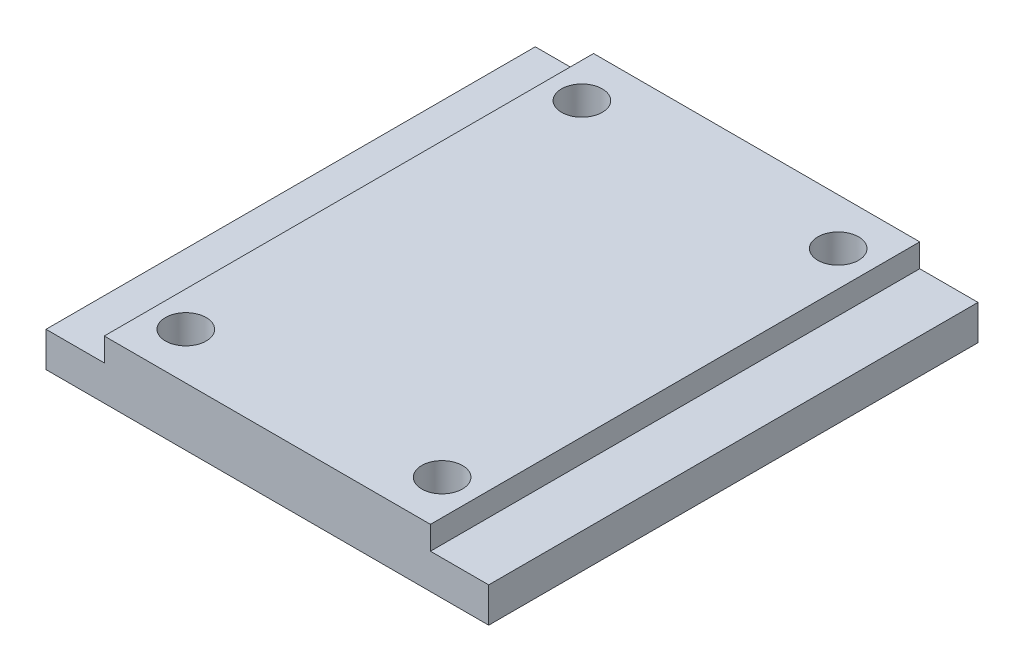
ISO-10303-21;
HEADER;
FILE_DESCRIPTION(('STEP AP214'),'2;1');
FILE_NAME('part.step','',(''),(''),'','','');
FILE_SCHEMA(('AUTOMOTIVE_DESIGN { 1 0 10303 214 1 1 1 1 }'));
ENDSEC;
DATA;
#1=APPLICATION_CONTEXT('core data for automotive mechanical design processes');
#2=APPLICATION_PROTOCOL_DEFINITION('international standard','automotive_design',2000,#1);
#3=PRODUCT_CONTEXT('',#1,'mechanical');
#4=PRODUCT('Part','Part','',(#3));
#5=PRODUCT_RELATED_PRODUCT_CATEGORY('part','',(#4));
#6=PRODUCT_DEFINITION_FORMATION('','',#4);
#7=PRODUCT_DEFINITION_CONTEXT('part definition',#1,'design');
#8=PRODUCT_DEFINITION('design','',#6,#7);
#9=PRODUCT_DEFINITION_SHAPE('','',#8);
#10=(LENGTH_UNIT() NAMED_UNIT(*) SI_UNIT(.MILLI.,.METRE.));
#11=(NAMED_UNIT(*) PLANE_ANGLE_UNIT() SI_UNIT($,.RADIAN.));
#12=(NAMED_UNIT(*) SI_UNIT($,.STERADIAN.) SOLID_ANGLE_UNIT());
#13=UNCERTAINTY_MEASURE_WITH_UNIT(LENGTH_MEASURE(1.E-05),#10,'distance_accuracy_value','');
#14=(GEOMETRIC_REPRESENTATION_CONTEXT(3) GLOBAL_UNCERTAINTY_ASSIGNED_CONTEXT((#13)) GLOBAL_UNIT_ASSIGNED_CONTEXT((#10,
#11,#12)) REPRESENTATION_CONTEXT('',''));
#15=CARTESIAN_POINT('',(0.,0.,0.));
#16=DIRECTION('',(0.,0.,1.));
#17=DIRECTION('',(1.,0.,0.));
#18=AXIS2_PLACEMENT_3D('',#15,#16,#17);
#19=CARTESIAN_POINT('',(0.,0.,21.));
#20=DIRECTION('',(0.,1.,0.));
#21=DIRECTION('',(-1.,0.,0.));
#22=AXIS2_PLACEMENT_3D('',#19,#20,#21);
#23=PLANE('',#22);
#24=DIRECTION('',(0.866025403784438,0.,-0.5));
#25=VECTOR('',#24,1.);
#26=CARTESIAN_POINT('',(-11.,0.,-13.5358983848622));
#27=LINE('',#26,#25);
#28=CARTESIAN_POINT('',(-11.,0.,-13.5358983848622));
#29=VERTEX_POINT('',#28);
#30=CARTESIAN_POINT('',(-8.,0.,-15.2679491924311));
#31=VERTEX_POINT('',#30);
#32=EDGE_CURVE('E433',#29,#31,#27,.T.);
#33=ORIENTED_EDGE('',*,*,#32,.T.);
#34=DIRECTION('',(0.,0.,-1.));
#35=VECTOR('',#34,1.);
#36=CARTESIAN_POINT('',(-8.,0.,-15.2679491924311));
#37=LINE('',#36,#35);
#38=CARTESIAN_POINT('',(-8.,0.,-18.7320508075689));
#39=VERTEX_POINT('',#38);
#40=EDGE_CURVE('E439',#31,#39,#37,.T.);
#41=ORIENTED_EDGE('',*,*,#40,.T.);
#42=DIRECTION('',(-0.866025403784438,0.,-0.500000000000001));
#43=VECTOR('',#42,1.);
#44=CARTESIAN_POINT('',(-8.,0.,-18.7320508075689));
#45=LINE('',#44,#43);
#46=CARTESIAN_POINT('',(-11.,0.,-20.4641016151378));
#47=VERTEX_POINT('',#46);
#48=EDGE_CURVE('E470',#39,#47,#45,.T.);
#49=ORIENTED_EDGE('',*,*,#48,.T.);
#50=DIRECTION('',(-0.866025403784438,0.,0.500000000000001));
#51=VECTOR('',#50,1.);
#52=CARTESIAN_POINT('',(-11.,0.,-20.4641016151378));
#53=LINE('',#52,#51);
#54=CARTESIAN_POINT('',(-14.,0.,-18.7320508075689));
#55=VERTEX_POINT('',#54);
#56=EDGE_CURVE('E466',#47,#55,#53,.T.);
#57=ORIENTED_EDGE('',*,*,#56,.T.);
#58=DIRECTION('',(0.,0.,1.));
#59=VECTOR('',#58,1.);
#60=CARTESIAN_POINT('',(-14.,0.,-18.7320508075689));
#61=LINE('',#60,#59);
#62=CARTESIAN_POINT('',(-14.,0.,-15.2679491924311));
#63=VERTEX_POINT('',#62);
#64=EDGE_CURVE('E462',#55,#63,#61,.T.);
#65=ORIENTED_EDGE('',*,*,#64,.T.);
#66=DIRECTION('',(0.866025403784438,0.,0.5));
#67=VECTOR('',#66,1.);
#68=CARTESIAN_POINT('',(-14.,0.,-15.2679491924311));
#69=LINE('',#68,#67);
#70=EDGE_CURVE('E458',#63,#29,#69,.T.);
#71=ORIENTED_EDGE('',*,*,#70,.T.);
#72=EDGE_LOOP('',(#33,#41,#49,#57,#65,#71));
#73=FACE_BOUND('',#72,.T.);
#74=DIRECTION('',(0.,0.,1.));
#75=VECTOR('',#74,1.);
#76=CARTESIAN_POINT('',(-8.,0.,15.2679491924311));
#77=LINE('',#76,#75);
#78=CARTESIAN_POINT('',(-8.,0.,15.2679491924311));
#79=VERTEX_POINT('',#78);
#80=CARTESIAN_POINT('',(-8.,0.,18.7320508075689));
#81=VERTEX_POINT('',#80);
#82=EDGE_CURVE('E530',#79,#81,#77,.T.);
#83=ORIENTED_EDGE('',*,*,#82,.F.);
#84=DIRECTION('',(0.866025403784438,0.,0.5));
#85=VECTOR('',#84,1.);
#86=CARTESIAN_POINT('',(-11.,0.,13.5358983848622));
#87=LINE('',#86,#85);
#88=CARTESIAN_POINT('',(-11.,0.,13.5358983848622));
#89=VERTEX_POINT('',#88);
#90=EDGE_CURVE('E501',#89,#79,#87,.T.);
#91=ORIENTED_EDGE('',*,*,#90,.F.);
#92=DIRECTION('',(0.866025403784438,0.,-0.5));
#93=VECTOR('',#92,1.);
#94=CARTESIAN_POINT('',(-14.,0.,15.2679491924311));
#95=LINE('',#94,#93);
#96=CARTESIAN_POINT('',(-14.,0.,15.2679491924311));
#97=VERTEX_POINT('',#96);
#98=EDGE_CURVE('E507',#97,#89,#95,.T.);
#99=ORIENTED_EDGE('',*,*,#98,.F.);
#100=DIRECTION('',(0.,0.,-1.));
#101=VECTOR('',#100,1.);
#102=CARTESIAN_POINT('',(-14.,0.,18.7320508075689));
#103=LINE('',#102,#101);
#104=CARTESIAN_POINT('',(-14.,0.,18.7320508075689));
#105=VERTEX_POINT('',#104);
#106=EDGE_CURVE('E542',#105,#97,#103,.T.);
#107=ORIENTED_EDGE('',*,*,#106,.F.);
#108=DIRECTION('',(-0.866025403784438,0.,-0.500000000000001));
#109=VECTOR('',#108,1.);
#110=CARTESIAN_POINT('',(-11.,0.,20.4641016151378));
#111=LINE('',#110,#109);
#112=CARTESIAN_POINT('',(-11.,0.,20.4641016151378));
#113=VERTEX_POINT('',#112);
#114=EDGE_CURVE('E538',#113,#105,#111,.T.);
#115=ORIENTED_EDGE('',*,*,#114,.F.);
#116=DIRECTION('',(-0.866025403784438,0.,0.500000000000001));
#117=VECTOR('',#116,1.);
#118=CARTESIAN_POINT('',(-8.,0.,18.7320508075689));
#119=LINE('',#118,#117);
#120=EDGE_CURVE('E534',#81,#113,#119,.T.);
#121=ORIENTED_EDGE('',*,*,#120,.F.);
#122=EDGE_LOOP('',(#83,#91,#99,#107,#115,#121));
#123=FACE_BOUND('',#122,.T.);
#124=DIRECTION('',(1.,0.,0.));
#125=VECTOR('',#124,1.);
#126=CARTESIAN_POINT('',(0.,0.,-21.));
#127=LINE('',#126,#125);
#128=CARTESIAN_POINT('',(-19.,0.,-21.));
#129=VERTEX_POINT('',#128);
#130=CARTESIAN_POINT('',(19.,0.,-21.));
#131=VERTEX_POINT('',#130);
#132=EDGE_CURVE('E577',#129,#131,#127,.T.);
#133=ORIENTED_EDGE('',*,*,#132,.T.);
#134=DIRECTION('',(0.,0.,-1.));
#135=VECTOR('',#134,1.);
#136=CARTESIAN_POINT('',(19.,0.,21.));
#137=LINE('',#136,#135);
#138=CARTESIAN_POINT('',(19.,0.,21.));
#139=VERTEX_POINT('',#138);
#140=EDGE_CURVE('E429',#139,#131,#137,.T.);
#141=ORIENTED_EDGE('',*,*,#140,.F.);
#142=DIRECTION('',(1.,0.,0.));
#143=VECTOR('',#142,1.);
#144=CARTESIAN_POINT('',(0.,0.,21.));
#145=LINE('',#144,#143);
#146=CARTESIAN_POINT('',(-19.,0.,21.));
#147=VERTEX_POINT('',#146);
#148=EDGE_CURVE('E586',#147,#139,#145,.T.);
#149=ORIENTED_EDGE('',*,*,#148,.F.);
#150=DIRECTION('',(0.,0.,-1.));
#151=VECTOR('',#150,1.);
#152=CARTESIAN_POINT('',(-19.,0.,21.));
#153=LINE('',#152,#151);
#154=EDGE_CURVE('E589',#147,#129,#153,.T.);
#155=ORIENTED_EDGE('',*,*,#154,.T.);
#156=EDGE_LOOP('',(#133,#141,#149,#155));
#157=FACE_BOUND('',#156,.T.);
#158=DIRECTION('',(0.,0.,-1.));
#159=VECTOR('',#158,1.);
#160=CARTESIAN_POINT('',(8.,0.,-15.2679491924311));
#161=LINE('',#160,#159);
#162=CARTESIAN_POINT('',(8.,0.,-15.2679491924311));
#163=VERTEX_POINT('',#162);
#164=CARTESIAN_POINT('',(8.,0.,-18.7320508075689));
#165=VERTEX_POINT('',#164);
#166=EDGE_CURVE('E354',#163,#165,#161,.T.);
#167=ORIENTED_EDGE('',*,*,#166,.F.);
#168=DIRECTION('',(-0.866025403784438,0.,-0.5));
#169=VECTOR('',#168,1.);
#170=CARTESIAN_POINT('',(11.,0.,-13.5358983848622));
#171=LINE('',#170,#169);
#172=CARTESIAN_POINT('',(11.,0.,-13.5358983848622));
#173=VERTEX_POINT('',#172);
#174=EDGE_CURVE('E65',#173,#163,#171,.T.);
#175=ORIENTED_EDGE('',*,*,#174,.F.);
#176=DIRECTION('',(-0.866025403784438,0.,0.5));
#177=VECTOR('',#176,1.);
#178=CARTESIAN_POINT('',(14.,0.,-15.2679491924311));
#179=LINE('',#178,#177);
#180=CARTESIAN_POINT('',(14.,0.,-15.2679491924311));
#181=VERTEX_POINT('',#180);
#182=EDGE_CURVE('E331',#181,#173,#179,.T.);
#183=ORIENTED_EDGE('',*,*,#182,.F.);
#184=DIRECTION('',(0.,0.,1.));
#185=VECTOR('',#184,1.);
#186=CARTESIAN_POINT('',(14.,0.,-18.7320508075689));
#187=LINE('',#186,#185);
#188=CARTESIAN_POINT('',(14.,0.,-18.7320508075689));
#189=VERTEX_POINT('',#188);
#190=EDGE_CURVE('E366',#189,#181,#187,.T.);
#191=ORIENTED_EDGE('',*,*,#190,.F.);
#192=DIRECTION('',(0.866025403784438,0.,0.500000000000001));
#193=VECTOR('',#192,1.);
#194=CARTESIAN_POINT('',(11.,0.,-20.4641016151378));
#195=LINE('',#194,#193);
#196=CARTESIAN_POINT('',(11.,0.,-20.4641016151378));
#197=VERTEX_POINT('',#196);
#198=EDGE_CURVE('E362',#197,#189,#195,.T.);
#199=ORIENTED_EDGE('',*,*,#198,.F.);
#200=DIRECTION('',(0.866025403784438,0.,-0.500000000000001));
#201=VECTOR('',#200,1.);
#202=CARTESIAN_POINT('',(8.,0.,-18.7320508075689));
#203=LINE('',#202,#201);
#204=EDGE_CURVE('E358',#165,#197,#203,.T.);
#205=ORIENTED_EDGE('',*,*,#204,.F.);
#206=EDGE_LOOP('',(#167,#175,#183,#191,#199,#205));
#207=FACE_BOUND('',#206,.T.);
#208=DIRECTION('',(-0.866025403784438,0.,0.5));
#209=VECTOR('',#208,1.);
#210=CARTESIAN_POINT('',(11.,0.,13.5358983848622));
#211=LINE('',#210,#209);
#212=CARTESIAN_POINT('',(11.,0.,13.5358983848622));
#213=VERTEX_POINT('',#212);
#214=CARTESIAN_POINT('',(8.,0.,15.2679491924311));
#215=VERTEX_POINT('',#214);
#216=EDGE_CURVE('E57',#213,#215,#211,.T.);
#217=ORIENTED_EDGE('',*,*,#216,.T.);
#218=DIRECTION('',(0.,0.,1.));
#219=VECTOR('',#218,1.);
#220=CARTESIAN_POINT('',(8.,0.,15.2679491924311));
#221=LINE('',#220,#219);
#222=CARTESIAN_POINT('',(8.,0.,18.7320508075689));
#223=VERTEX_POINT('',#222);
#224=EDGE_CURVE('E275',#215,#223,#221,.T.);
#225=ORIENTED_EDGE('',*,*,#224,.T.);
#226=DIRECTION('',(0.866025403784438,0.,0.500000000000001));
#227=VECTOR('',#226,1.);
#228=CARTESIAN_POINT('',(8.,0.,18.7320508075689));
#229=LINE('',#228,#227);
#230=CARTESIAN_POINT('',(11.,0.,20.4641016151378));
#231=VERTEX_POINT('',#230);
#232=EDGE_CURVE('E279',#223,#231,#229,.T.);
#233=ORIENTED_EDGE('',*,*,#232,.T.);
#234=DIRECTION('',(0.866025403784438,0.,-0.500000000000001));
#235=VECTOR('',#234,1.);
#236=CARTESIAN_POINT('',(11.,0.,20.4641016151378));
#237=LINE('',#236,#235);
#238=CARTESIAN_POINT('',(14.,0.,18.7320508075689));
#239=VERTEX_POINT('',#238);
#240=EDGE_CURVE('E301',#231,#239,#237,.T.);
#241=ORIENTED_EDGE('',*,*,#240,.T.);
#242=DIRECTION('',(0.,0.,-1.));
#243=VECTOR('',#242,1.);
#244=CARTESIAN_POINT('',(14.,0.,18.7320508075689));
#245=LINE('',#244,#243);
#246=CARTESIAN_POINT('',(14.,0.,15.2679491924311));
#247=VERTEX_POINT('',#246);
#248=EDGE_CURVE('E297',#239,#247,#245,.T.);
#249=ORIENTED_EDGE('',*,*,#248,.T.);
#250=DIRECTION('',(-0.866025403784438,0.,-0.5));
#251=VECTOR('',#250,1.);
#252=CARTESIAN_POINT('',(14.,0.,15.2679491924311));
#253=LINE('',#252,#251);
#254=EDGE_CURVE('E294',#247,#213,#253,.T.);
#255=ORIENTED_EDGE('',*,*,#254,.T.);
#256=EDGE_LOOP('',(#217,#225,#233,#241,#249,#255));
#257=FACE_BOUND('',#256,.T.);
#258=ADVANCED_FACE('F39',(#73,#123,#157,#207,#257),#23,.F.);
#259=CARTESIAN_POINT('',(11.,0.,17.));
#260=DIRECTION('',(0.,1.,0.));
#261=DIRECTION('',(0.,0.,1.));
#262=AXIS2_PLACEMENT_3D('',#259,#260,#261);
#263=CYLINDRICAL_SURFACE('',#262,1.75);
#264=CARTESIAN_POINT('',(11.,5.,17.));
#265=DIRECTION('',(0.,-1.,0.));
#266=DIRECTION('',(0.,0.,1.));
#267=AXIS2_PLACEMENT_3D('',#264,#265,#266);
#268=CIRCLE('',#267,1.75);
#269=CARTESIAN_POINT('',(11.,5.,18.75));
#270=VERTEX_POINT('',#269);
#271=EDGE_CURVE('E322',#270,#270,#268,.T.);
#272=ORIENTED_EDGE('',*,*,#271,.F.);
#273=EDGE_LOOP('',(#272));
#274=FACE_BOUND('',#273,.T.);
#275=CARTESIAN_POINT('',(11.,2.5,17.));
#276=DIRECTION('',(0.,-1.,0.));
#277=DIRECTION('',(1.,0.,0.));
#278=AXIS2_PLACEMENT_3D('',#275,#276,#277);
#279=CIRCLE('',#278,1.75);
#280=CARTESIAN_POINT('',(12.75,2.5,17.));
#281=VERTEX_POINT('',#280);
#282=EDGE_CURVE('E43',#281,#281,#279,.T.);
#283=ORIENTED_EDGE('',*,*,#282,.T.);
#284=EDGE_LOOP('',(#283));
#285=FACE_BOUND('',#284,.T.);
#286=ADVANCED_FACE('F627',(#274,#285),#263,.F.);
#287=CARTESIAN_POINT('',(11.,0.,-17.));
#288=DIRECTION('',(0.,1.,0.));
#289=DIRECTION('',(0.,0.,1.));
#290=AXIS2_PLACEMENT_3D('',#287,#288,#289);
#291=CYLINDRICAL_SURFACE('',#290,1.75);
#292=CARTESIAN_POINT('',(11.,5.,-17.));
#293=DIRECTION('',(0.,1.,0.));
#294=DIRECTION('',(0.,0.,-1.));
#295=AXIS2_PLACEMENT_3D('',#292,#293,#294);
#296=CIRCLE('',#295,1.75);
#297=CARTESIAN_POINT('',(11.,5.,-18.75));
#298=VERTEX_POINT('',#297);
#299=EDGE_CURVE('E391',#298,#298,#296,.T.);
#300=ORIENTED_EDGE('',*,*,#299,.T.);
#301=EDGE_LOOP('',(#300));
#302=FACE_BOUND('',#301,.T.);
#303=CARTESIAN_POINT('',(11.,2.5,-17.));
#304=DIRECTION('',(0.,-1.,0.));
#305=DIRECTION('',(1.,0.,0.));
#306=AXIS2_PLACEMENT_3D('',#303,#304,#305);
#307=CIRCLE('',#306,1.75);
#308=CARTESIAN_POINT('',(12.75,2.5,-17.));
#309=VERTEX_POINT('',#308);
#310=EDGE_CURVE('E376',#309,#309,#307,.F.);
#311=ORIENTED_EDGE('',*,*,#310,.F.);
#312=EDGE_LOOP('',(#311));
#313=FACE_BOUND('',#312,.T.);
#314=ADVANCED_FACE('F624',(#302,#313),#291,.F.);
#315=CARTESIAN_POINT('',(-11.,0.,-17.));
#316=DIRECTION('',(0.,1.,0.));
#317=DIRECTION('',(0.,0.,1.));
#318=AXIS2_PLACEMENT_3D('',#315,#316,#317);
#319=CYLINDRICAL_SURFACE('',#318,1.75);
#320=CARTESIAN_POINT('',(-11.,5.,-17.));
#321=DIRECTION('',(0.,-1.,0.));
#322=DIRECTION('',(0.,0.,-1.));
#323=AXIS2_PLACEMENT_3D('',#320,#321,#322);
#324=CIRCLE('',#323,1.75);
#325=CARTESIAN_POINT('',(-11.,5.,-18.75));
#326=VERTEX_POINT('',#325);
#327=EDGE_CURVE('E497',#326,#326,#324,.T.);
#328=ORIENTED_EDGE('',*,*,#327,.F.);
#329=EDGE_LOOP('',(#328));
#330=FACE_BOUND('',#329,.T.);
#331=CARTESIAN_POINT('',(-11.,2.5,-17.));
#332=DIRECTION('',(0.,-1.,0.));
#333=DIRECTION('',(1.,0.,0.));
#334=AXIS2_PLACEMENT_3D('',#331,#332,#333);
#335=CIRCLE('',#334,1.75);
#336=CARTESIAN_POINT('',(-9.25,2.5,-17.));
#337=VERTEX_POINT('',#336);
#338=EDGE_CURVE('E481',#337,#337,#335,.T.);
#339=ORIENTED_EDGE('',*,*,#338,.T.);
#340=EDGE_LOOP('',(#339));
#341=FACE_BOUND('',#340,.T.);
#342=ADVANCED_FACE('F626',(#330,#341),#319,.F.);
#343=CARTESIAN_POINT('',(-11.,0.,17.));
#344=DIRECTION('',(0.,1.,0.));
#345=DIRECTION('',(0.,0.,1.));
#346=AXIS2_PLACEMENT_3D('',#343,#344,#345);
#347=CYLINDRICAL_SURFACE('',#346,1.75);
#348=CARTESIAN_POINT('',(-11.,5.,17.));
#349=DIRECTION('',(0.,1.,0.));
#350=DIRECTION('',(0.,0.,1.));
#351=AXIS2_PLACEMENT_3D('',#348,#349,#350);
#352=CIRCLE('',#351,1.75);
#353=CARTESIAN_POINT('',(-11.,5.,18.75));
#354=VERTEX_POINT('',#353);
#355=EDGE_CURVE('E568',#354,#354,#352,.T.);
#356=ORIENTED_EDGE('',*,*,#355,.T.);
#357=EDGE_LOOP('',(#356));
#358=FACE_BOUND('',#357,.T.);
#359=CARTESIAN_POINT('',(-11.,2.5,17.));
#360=DIRECTION('',(0.,-1.,0.));
#361=DIRECTION('',(1.,0.,0.));
#362=AXIS2_PLACEMENT_3D('',#359,#360,#361);
#363=CIRCLE('',#362,1.75);
#364=CARTESIAN_POINT('',(-9.25,2.5,17.));
#365=VERTEX_POINT('',#364);
#366=EDGE_CURVE('E552',#365,#365,#363,.F.);
#367=ORIENTED_EDGE('',*,*,#366,.F.);
#368=EDGE_LOOP('',(#367));
#369=FACE_BOUND('',#368,.T.);
#370=ADVANCED_FACE('F634',(#358,#369),#347,.F.);
#371=CARTESIAN_POINT('',(-14.,5.,21.));
#372=DIRECTION('',(0.,-1.,0.));
#373=DIRECTION('',(0.,0.,-1.));
#374=AXIS2_PLACEMENT_3D('',#371,#372,#373);
#375=PLANE('',#374);
#376=ORIENTED_EDGE('',*,*,#271,.T.);
#377=EDGE_LOOP('',(#376));
#378=FACE_BOUND('',#377,.T.);
#379=ORIENTED_EDGE('',*,*,#299,.F.);
#380=EDGE_LOOP('',(#379));
#381=FACE_BOUND('',#380,.T.);
#382=ORIENTED_EDGE('',*,*,#327,.T.);
#383=EDGE_LOOP('',(#382));
#384=FACE_BOUND('',#383,.T.);
#385=ORIENTED_EDGE('',*,*,#355,.F.);
#386=EDGE_LOOP('',(#385));
#387=FACE_BOUND('',#386,.T.);
#388=DIRECTION('',(-1.,0.,0.));
#389=VECTOR('',#388,1.);
#390=CARTESIAN_POINT('',(-14.,5.,-21.));
#391=LINE('',#390,#389);
#392=CARTESIAN_POINT('',(14.,5.,-21.));
#393=VERTEX_POINT('',#392);
#394=CARTESIAN_POINT('',(-14.,5.,-21.));
#395=VERTEX_POINT('',#394);
#396=EDGE_CURVE('E572',#393,#395,#391,.T.);
#397=ORIENTED_EDGE('',*,*,#396,.T.);
#398=DIRECTION('',(0.,0.,-1.));
#399=VECTOR('',#398,1.);
#400=CARTESIAN_POINT('',(-14.,5.,21.));
#401=LINE('',#400,#399);
#402=CARTESIAN_POINT('',(-14.,5.,21.));
#403=VERTEX_POINT('',#402);
#404=EDGE_CURVE('E11',#403,#395,#401,.T.);
#405=ORIENTED_EDGE('',*,*,#404,.F.);
#406=DIRECTION('',(-1.,0.,0.));
#407=VECTOR('',#406,1.);
#408=CARTESIAN_POINT('',(-14.,5.,21.));
#409=LINE('',#408,#407);
#410=CARTESIAN_POINT('',(14.,5.,21.));
#411=VERTEX_POINT('',#410);
#412=EDGE_CURVE('E573',#411,#403,#409,.T.);
#413=ORIENTED_EDGE('',*,*,#412,.F.);
#414=DIRECTION('',(0.,0.,-1.));
#415=VECTOR('',#414,1.);
#416=CARTESIAN_POINT('',(14.,5.,21.));
#417=LINE('',#416,#415);
#418=EDGE_CURVE('E409',#411,#393,#417,.T.);
#419=ORIENTED_EDGE('',*,*,#418,.T.);
#420=EDGE_LOOP('',(#397,#405,#413,#419));
#421=FACE_BOUND('',#420,.T.);
#422=ADVANCED_FACE('F41',(#378,#381,#384,#387,#421),#375,.F.);
#423=CARTESIAN_POINT('',(-14.,3.,21.));
#424=DIRECTION('',(1.,0.,0.));
#425=DIRECTION('',(0.,0.,-1.));
#426=AXIS2_PLACEMENT_3D('',#423,#424,#425);
#427=PLANE('',#426);
#428=DIRECTION('',(0.,-1.,0.));
#429=VECTOR('',#428,1.);
#430=CARTESIAN_POINT('',(-14.,3.,-21.));
#431=LINE('',#430,#429);
#432=CARTESIAN_POINT('',(-14.,3.,-21.));
#433=VERTEX_POINT('',#432);
#434=EDGE_CURVE('E592',#395,#433,#431,.T.);
#435=ORIENTED_EDGE('',*,*,#434,.T.);
#436=DIRECTION('',(0.,0.,-1.));
#437=VECTOR('',#436,1.);
#438=CARTESIAN_POINT('',(-14.,3.,21.));
#439=LINE('',#438,#437);
#440=CARTESIAN_POINT('',(-14.,3.,21.));
#441=VERTEX_POINT('',#440);
#442=EDGE_CURVE('E49',#441,#433,#439,.T.);
#443=ORIENTED_EDGE('',*,*,#442,.F.);
#444=DIRECTION('',(0.,-1.,0.));
#445=VECTOR('',#444,1.);
#446=CARTESIAN_POINT('',(-14.,3.,21.));
#447=LINE('',#446,#445);
#448=EDGE_CURVE('E576',#403,#441,#447,.T.);
#449=ORIENTED_EDGE('',*,*,#448,.F.);
#450=ORIENTED_EDGE('',*,*,#404,.T.);
#451=EDGE_LOOP('',(#435,#443,#449,#450));
#452=FACE_BOUND('',#451,.T.);
#453=ADVANCED_FACE('F658',(#452),#427,.F.);
#454=CARTESIAN_POINT('',(-19.,3.,21.));
#455=DIRECTION('',(0.,-1.,0.));
#456=DIRECTION('',(0.,0.,-1.));
#457=AXIS2_PLACEMENT_3D('',#454,#455,#456);
#458=PLANE('',#457);
#459=DIRECTION('',(-1.,0.,0.));
#460=VECTOR('',#459,1.);
#461=CARTESIAN_POINT('',(-19.,3.,-21.));
#462=LINE('',#461,#460);
#463=CARTESIAN_POINT('',(-19.,3.,-21.));
#464=VERTEX_POINT('',#463);
#465=EDGE_CURVE('E595',#433,#464,#462,.T.);
#466=ORIENTED_EDGE('',*,*,#465,.T.);
#467=DIRECTION('',(0.,0.,-1.));
#468=VECTOR('',#467,1.);
#469=CARTESIAN_POINT('',(-19.,3.,21.));
#470=LINE('',#469,#468);
#471=CARTESIAN_POINT('',(-19.,3.,21.));
#472=VERTEX_POINT('',#471);
#473=EDGE_CURVE('E606',#472,#464,#470,.T.);
#474=ORIENTED_EDGE('',*,*,#473,.F.);
#475=DIRECTION('',(-1.,0.,0.));
#476=VECTOR('',#475,1.);
#477=CARTESIAN_POINT('',(-19.,3.,21.));
#478=LINE('',#477,#476);
#479=EDGE_CURVE('E580',#441,#472,#478,.T.);
#480=ORIENTED_EDGE('',*,*,#479,.F.);
#481=ORIENTED_EDGE('',*,*,#442,.T.);
#482=EDGE_LOOP('',(#466,#474,#480,#481));
#483=FACE_BOUND('',#482,.T.);
#484=ADVANCED_FACE('F655',(#483),#458,.F.);
#485=CARTESIAN_POINT('',(-19.,0.,21.));
#486=DIRECTION('',(1.,0.,0.));
#487=DIRECTION('',(0.,0.,-1.));
#488=AXIS2_PLACEMENT_3D('',#485,#486,#487);
#489=PLANE('',#488);
#490=DIRECTION('',(0.,-1.,0.));
#491=VECTOR('',#490,1.);
#492=CARTESIAN_POINT('',(-19.,0.,-21.));
#493=LINE('',#492,#491);
#494=EDGE_CURVE('E598',#464,#129,#493,.T.);
#495=ORIENTED_EDGE('',*,*,#494,.T.);
#496=ORIENTED_EDGE('',*,*,#154,.F.);
#497=DIRECTION('',(0.,-1.,0.));
#498=VECTOR('',#497,1.);
#499=CARTESIAN_POINT('',(-19.,0.,21.));
#500=LINE('',#499,#498);
#501=EDGE_CURVE('E583',#472,#147,#500,.T.);
#502=ORIENTED_EDGE('',*,*,#501,.F.);
#503=ORIENTED_EDGE('',*,*,#473,.T.);
#504=EDGE_LOOP('',(#495,#496,#502,#503));
#505=FACE_BOUND('',#504,.T.);
#506=ADVANCED_FACE('F651',(#505),#489,.F.);
#507=CARTESIAN_POINT('',(0.,0.,21.));
#508=DIRECTION('',(0.,0.,-1.));
#509=DIRECTION('',(-1.,0.,0.));
#510=AXIS2_PLACEMENT_3D('',#507,#508,#509);
#511=PLANE('',#510);
#512=ORIENTED_EDGE('',*,*,#148,.T.);
#513=DIRECTION('',(0.,-1.,0.));
#514=VECTOR('',#513,1.);
#515=CARTESIAN_POINT('',(19.,0.,21.));
#516=LINE('',#515,#514);
#517=CARTESIAN_POINT('',(19.,3.,21.));
#518=VERTEX_POINT('',#517);
#519=EDGE_CURVE('E396',#518,#139,#516,.T.);
#520=ORIENTED_EDGE('',*,*,#519,.F.);
#521=DIRECTION('',(1.,0.,0.));
#522=VECTOR('',#521,1.);
#523=CARTESIAN_POINT('',(19.,3.,21.));
#524=LINE('',#523,#522);
#525=CARTESIAN_POINT('',(14.,3.,21.));
#526=VERTEX_POINT('',#525);
#527=EDGE_CURVE('E400',#526,#518,#524,.T.);
#528=ORIENTED_EDGE('',*,*,#527,.F.);
#529=DIRECTION('',(0.,-1.,0.));
#530=VECTOR('',#529,1.);
#531=CARTESIAN_POINT('',(14.,3.,21.));
#532=LINE('',#531,#530);
#533=EDGE_CURVE('E405',#411,#526,#532,.T.);
#534=ORIENTED_EDGE('',*,*,#533,.F.);
#535=ORIENTED_EDGE('',*,*,#412,.T.);
#536=ORIENTED_EDGE('',*,*,#448,.T.);
#537=ORIENTED_EDGE('',*,*,#479,.T.);
#538=ORIENTED_EDGE('',*,*,#501,.T.);
#539=EDGE_LOOP('',(#512,#520,#528,#534,#535,#536,#537,#538));
#540=FACE_BOUND('',#539,.T.);
#541=ADVANCED_FACE('F654',(#540),#511,.F.);
#542=CARTESIAN_POINT('',(0.,0.,-21.));
#543=DIRECTION('',(0.,0.,-1.));
#544=DIRECTION('',(-1.,0.,0.));
#545=AXIS2_PLACEMENT_3D('',#542,#543,#544);
#546=PLANE('',#545);
#547=ORIENTED_EDGE('',*,*,#396,.F.);
#548=DIRECTION('',(0.,-1.,0.));
#549=VECTOR('',#548,1.);
#550=CARTESIAN_POINT('',(14.,3.,-21.));
#551=LINE('',#550,#549);
#552=CARTESIAN_POINT('',(14.,3.,-21.));
#553=VERTEX_POINT('',#552);
#554=EDGE_CURVE('E401',#393,#553,#551,.T.);
#555=ORIENTED_EDGE('',*,*,#554,.T.);
#556=DIRECTION('',(1.,0.,0.));
#557=VECTOR('',#556,1.);
#558=CARTESIAN_POINT('',(19.,3.,-21.));
#559=LINE('',#558,#557);
#560=CARTESIAN_POINT('',(19.,3.,-21.));
#561=VERTEX_POINT('',#560);
#562=EDGE_CURVE('E413',#553,#561,#559,.T.);
#563=ORIENTED_EDGE('',*,*,#562,.T.);
#564=DIRECTION('',(0.,-1.,0.));
#565=VECTOR('',#564,1.);
#566=CARTESIAN_POINT('',(19.,0.,-21.));
#567=LINE('',#566,#565);
#568=EDGE_CURVE('E395',#561,#131,#567,.T.);
#569=ORIENTED_EDGE('',*,*,#568,.T.);
#570=ORIENTED_EDGE('',*,*,#132,.F.);
#571=ORIENTED_EDGE('',*,*,#494,.F.);
#572=ORIENTED_EDGE('',*,*,#465,.F.);
#573=ORIENTED_EDGE('',*,*,#434,.F.);
#574=EDGE_LOOP('',(#547,#555,#563,#569,#570,#571,#572,#573));
#575=FACE_BOUND('',#574,.T.);
#576=ADVANCED_FACE('F649',(#575),#546,.T.);
#577=CARTESIAN_POINT('',(0.,2.5,0.));
#578=DIRECTION('',(0.,-1.,0.));
#579=DIRECTION('',(1.,0.,0.));
#580=AXIS2_PLACEMENT_3D('',#577,#578,#579);
#581=PLANE('',#580);
#582=DIRECTION('',(0.866025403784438,0.,0.5));
#583=VECTOR('',#582,1.);
#584=CARTESIAN_POINT('',(-11.,2.5,13.5358983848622));
#585=LINE('',#584,#583);
#586=CARTESIAN_POINT('',(-11.,2.5,13.5358983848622));
#587=VERTEX_POINT('',#586);
#588=CARTESIAN_POINT('',(-8.,2.5,15.2679491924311));
#589=VERTEX_POINT('',#588);
#590=EDGE_CURVE('E502',#587,#589,#585,.T.);
#591=ORIENTED_EDGE('',*,*,#590,.T.);
#592=DIRECTION('',(0.,0.,1.));
#593=VECTOR('',#592,1.);
#594=CARTESIAN_POINT('',(-8.,2.5,15.2679491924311));
#595=LINE('',#594,#593);
#596=CARTESIAN_POINT('',(-8.,2.5,18.7320508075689));
#597=VERTEX_POINT('',#596);
#598=EDGE_CURVE('E506',#589,#597,#595,.T.);
#599=ORIENTED_EDGE('',*,*,#598,.T.);
#600=DIRECTION('',(-0.866025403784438,0.,0.500000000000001));
#601=VECTOR('',#600,1.);
#602=CARTESIAN_POINT('',(-8.,2.5,18.7320508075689));
#603=LINE('',#602,#601);
#604=CARTESIAN_POINT('',(-11.,2.5,20.4641016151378));
#605=VERTEX_POINT('',#604);
#606=EDGE_CURVE('E511',#597,#605,#603,.T.);
#607=ORIENTED_EDGE('',*,*,#606,.T.);
#608=DIRECTION('',(-0.866025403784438,0.,-0.500000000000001));
#609=VECTOR('',#608,1.);
#610=CARTESIAN_POINT('',(-11.,2.5,20.4641016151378));
#611=LINE('',#610,#609);
#612=CARTESIAN_POINT('',(-14.,2.5,18.7320508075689));
#613=VERTEX_POINT('',#612);
#614=EDGE_CURVE('E515',#605,#613,#611,.T.);
#615=ORIENTED_EDGE('',*,*,#614,.T.);
#616=DIRECTION('',(0.,0.,-1.));
#617=VECTOR('',#616,1.);
#618=CARTESIAN_POINT('',(-14.,2.5,18.7320508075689));
#619=LINE('',#618,#617);
#620=CARTESIAN_POINT('',(-14.,2.5,15.2679491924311));
#621=VERTEX_POINT('',#620);
#622=EDGE_CURVE('E519',#613,#621,#619,.T.);
#623=ORIENTED_EDGE('',*,*,#622,.T.);
#624=DIRECTION('',(0.866025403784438,0.,-0.5));
#625=VECTOR('',#624,1.);
#626=CARTESIAN_POINT('',(-14.,2.5,15.2679491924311));
#627=LINE('',#626,#625);
#628=EDGE_CURVE('E523',#621,#587,#627,.T.);
#629=ORIENTED_EDGE('',*,*,#628,.T.);
#630=EDGE_LOOP('',(#591,#599,#607,#615,#623,#629));
#631=FACE_BOUND('',#630,.T.);
#632=ORIENTED_EDGE('',*,*,#366,.T.);
#633=EDGE_LOOP('',(#632));
#634=FACE_BOUND('',#633,.T.);
#635=ADVANCED_FACE('F733',(#631,#634),#581,.T.);
#636=CARTESIAN_POINT('',(-11.,2.5,13.5358983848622));
#637=DIRECTION('',(0.5,0.,-0.866025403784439));
#638=DIRECTION('',(-0.866025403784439,0.,-0.5));
#639=AXIS2_PLACEMENT_3D('',#636,#637,#638);
#640=PLANE('',#639);
#641=ORIENTED_EDGE('',*,*,#90,.T.);
#642=DIRECTION('',(0.,-1.,0.));
#643=VECTOR('',#642,1.);
#644=CARTESIAN_POINT('',(-8.,2.5,15.2679491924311));
#645=LINE('',#644,#643);
#646=EDGE_CURVE('E527',#589,#79,#645,.T.);
#647=ORIENTED_EDGE('',*,*,#646,.F.);
#648=ORIENTED_EDGE('',*,*,#590,.F.);
#649=DIRECTION('',(0.,-1.,0.));
#650=VECTOR('',#649,1.);
#651=CARTESIAN_POINT('',(-11.,2.5,13.5358983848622));
#652=LINE('',#651,#650);
#653=EDGE_CURVE('E549',#587,#89,#652,.T.);
#654=ORIENTED_EDGE('',*,*,#653,.T.);
#655=EDGE_LOOP('',(#641,#647,#648,#654));
#656=FACE_BOUND('',#655,.T.);
#657=ADVANCED_FACE('F736',(#656),#640,.F.);
#658=CARTESIAN_POINT('',(-14.,2.5,15.2679491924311));
#659=DIRECTION('',(-0.5,0.,-0.866025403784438));
#660=DIRECTION('',(-0.866025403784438,0.,0.5));
#661=AXIS2_PLACEMENT_3D('',#658,#659,#660);
#662=PLANE('',#661);
#663=ORIENTED_EDGE('',*,*,#98,.T.);
#664=ORIENTED_EDGE('',*,*,#653,.F.);
#665=ORIENTED_EDGE('',*,*,#628,.F.);
#666=DIRECTION('',(0.,-1.,0.));
#667=VECTOR('',#666,1.);
#668=CARTESIAN_POINT('',(-14.,2.5,15.2679491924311));
#669=LINE('',#668,#667);
#670=EDGE_CURVE('E553',#621,#97,#669,.T.);
#671=ORIENTED_EDGE('',*,*,#670,.T.);
#672=EDGE_LOOP('',(#663,#664,#665,#671));
#673=FACE_BOUND('',#672,.T.);
#674=ADVANCED_FACE('F738',(#673),#662,.F.);
#675=CARTESIAN_POINT('',(-14.,2.5,18.7320508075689));
#676=DIRECTION('',(-1.,0.,0.));
#677=DIRECTION('',(0.,-1.,0.));
#678=AXIS2_PLACEMENT_3D('',#675,#676,#677);
#679=PLANE('',#678);
#680=ORIENTED_EDGE('',*,*,#106,.T.);
#681=ORIENTED_EDGE('',*,*,#670,.F.);
#682=ORIENTED_EDGE('',*,*,#622,.F.);
#683=DIRECTION('',(0.,-1.,0.));
#684=VECTOR('',#683,1.);
#685=CARTESIAN_POINT('',(-14.,2.5,18.7320508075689));
#686=LINE('',#685,#684);
#687=EDGE_CURVE('E556',#613,#105,#686,.T.);
#688=ORIENTED_EDGE('',*,*,#687,.T.);
#689=EDGE_LOOP('',(#680,#681,#682,#688));
#690=FACE_BOUND('',#689,.T.);
#691=ADVANCED_FACE('F741',(#690),#679,.F.);
#692=CARTESIAN_POINT('',(-11.,2.5,20.4641016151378));
#693=DIRECTION('',(-0.500000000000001,0.,0.866025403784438));
#694=DIRECTION('',(0.866025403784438,0.,0.500000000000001));
#695=AXIS2_PLACEMENT_3D('',#692,#693,#694);
#696=PLANE('',#695);
#697=ORIENTED_EDGE('',*,*,#114,.T.);
#698=ORIENTED_EDGE('',*,*,#687,.F.);
#699=ORIENTED_EDGE('',*,*,#614,.F.);
#700=DIRECTION('',(0.,-1.,0.));
#701=VECTOR('',#700,1.);
#702=CARTESIAN_POINT('',(-11.,2.5,20.4641016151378));
#703=LINE('',#702,#701);
#704=EDGE_CURVE('E559',#605,#113,#703,.T.);
#705=ORIENTED_EDGE('',*,*,#704,.T.);
#706=EDGE_LOOP('',(#697,#698,#699,#705));
#707=FACE_BOUND('',#706,.T.);
#708=ADVANCED_FACE('F745',(#707),#696,.F.);
#709=CARTESIAN_POINT('',(-8.,2.5,18.7320508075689));
#710=DIRECTION('',(0.500000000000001,0.,0.866025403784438));
#711=DIRECTION('',(0.866025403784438,0.,-0.500000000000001));
#712=AXIS2_PLACEMENT_3D('',#709,#710,#711);
#713=PLANE('',#712);
#714=ORIENTED_EDGE('',*,*,#120,.T.);
#715=ORIENTED_EDGE('',*,*,#704,.F.);
#716=ORIENTED_EDGE('',*,*,#606,.F.);
#717=DIRECTION('',(0.,-1.,0.));
#718=VECTOR('',#717,1.);
#719=CARTESIAN_POINT('',(-8.,2.5,18.7320508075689));
#720=LINE('',#719,#718);
#721=EDGE_CURVE('E562',#597,#81,#720,.T.);
#722=ORIENTED_EDGE('',*,*,#721,.T.);
#723=EDGE_LOOP('',(#714,#715,#716,#722));
#724=FACE_BOUND('',#723,.T.);
#725=ADVANCED_FACE('F749',(#724),#713,.F.);
#726=CARTESIAN_POINT('',(-8.,2.5,15.2679491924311));
#727=DIRECTION('',(1.,0.,0.));
#728=DIRECTION('',(0.,1.,0.));
#729=AXIS2_PLACEMENT_3D('',#726,#727,#728);
#730=PLANE('',#729);
#731=ORIENTED_EDGE('',*,*,#82,.T.);
#732=ORIENTED_EDGE('',*,*,#721,.F.);
#733=ORIENTED_EDGE('',*,*,#598,.F.);
#734=ORIENTED_EDGE('',*,*,#646,.T.);
#735=EDGE_LOOP('',(#731,#732,#733,#734));
#736=FACE_BOUND('',#735,.T.);
#737=ADVANCED_FACE('F730',(#736),#730,.F.);
#738=CARTESIAN_POINT('',(-11.,2.5,-13.5358983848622));
#739=DIRECTION('',(-0.5,0.,-0.866025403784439));
#740=DIRECTION('',(-0.866025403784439,0.,0.5));
#741=AXIS2_PLACEMENT_3D('',#738,#739,#740);
#742=PLANE('',#741);
#743=ORIENTED_EDGE('',*,*,#32,.F.);
#744=DIRECTION('',(0.,-1.,0.));
#745=VECTOR('',#744,1.);
#746=CARTESIAN_POINT('',(-11.,2.5,-13.5358983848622));
#747=LINE('',#746,#745);
#748=CARTESIAN_POINT('',(-11.,2.5,-13.5358983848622));
#749=VERTEX_POINT('',#748);
#750=EDGE_CURVE('E454',#749,#29,#747,.T.);
#751=ORIENTED_EDGE('',*,*,#750,.F.);
#752=DIRECTION('',(0.866025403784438,0.,-0.5));
#753=VECTOR('',#752,1.);
#754=CARTESIAN_POINT('',(-11.,2.5,-13.5358983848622));
#755=LINE('',#754,#753);
#756=CARTESIAN_POINT('',(-8.,2.5,-15.2679491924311));
#757=VERTEX_POINT('',#756);
#758=EDGE_CURVE('E434',#749,#757,#755,.T.);
#759=ORIENTED_EDGE('',*,*,#758,.T.);
#760=DIRECTION('',(0.,-1.,0.));
#761=VECTOR('',#760,1.);
#762=CARTESIAN_POINT('',(-8.,2.5,-15.2679491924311));
#763=LINE('',#762,#761);
#764=EDGE_CURVE('E477',#757,#31,#763,.T.);
#765=ORIENTED_EDGE('',*,*,#764,.T.);
#766=EDGE_LOOP('',(#743,#751,#759,#765));
#767=FACE_BOUND('',#766,.T.);
#768=ADVANCED_FACE('F713',(#767),#742,.T.);
#769=CARTESIAN_POINT('',(-8.,2.5,-15.2679491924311));
#770=DIRECTION('',(-1.,0.,0.));
#771=DIRECTION('',(0.,-1.,0.));
#772=AXIS2_PLACEMENT_3D('',#769,#770,#771);
#773=PLANE('',#772);
#774=ORIENTED_EDGE('',*,*,#40,.F.);
#775=ORIENTED_EDGE('',*,*,#764,.F.);
#776=DIRECTION('',(0.,0.,-1.));
#777=VECTOR('',#776,1.);
#778=CARTESIAN_POINT('',(-8.,2.5,-15.2679491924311));
#779=LINE('',#778,#777);
#780=CARTESIAN_POINT('',(-8.,2.5,-18.7320508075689));
#781=VERTEX_POINT('',#780);
#782=EDGE_CURVE('E451',#757,#781,#779,.T.);
#783=ORIENTED_EDGE('',*,*,#782,.T.);
#784=DIRECTION('',(0.,-1.,0.));
#785=VECTOR('',#784,1.);
#786=CARTESIAN_POINT('',(-8.,2.5,-18.7320508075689));
#787=LINE('',#786,#785);
#788=EDGE_CURVE('E482',#781,#39,#787,.T.);
#789=ORIENTED_EDGE('',*,*,#788,.T.);
#790=EDGE_LOOP('',(#774,#775,#783,#789));
#791=FACE_BOUND('',#790,.T.);
#792=ADVANCED_FACE('F709',(#791),#773,.T.);
#793=CARTESIAN_POINT('',(-8.,2.5,-18.7320508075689));
#794=DIRECTION('',(-0.500000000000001,0.,0.866025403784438));
#795=DIRECTION('',(0.866025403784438,0.,0.500000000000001));
#796=AXIS2_PLACEMENT_3D('',#793,#794,#795);
#797=PLANE('',#796);
#798=ORIENTED_EDGE('',*,*,#48,.F.);
#799=ORIENTED_EDGE('',*,*,#788,.F.);
#800=DIRECTION('',(-0.866025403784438,0.,-0.500000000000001));
#801=VECTOR('',#800,1.);
#802=CARTESIAN_POINT('',(-8.,2.5,-18.7320508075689));
#803=LINE('',#802,#801);
#804=CARTESIAN_POINT('',(-11.,2.5,-20.4641016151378));
#805=VERTEX_POINT('',#804);
#806=EDGE_CURVE('E448',#781,#805,#803,.T.);
#807=ORIENTED_EDGE('',*,*,#806,.T.);
#808=DIRECTION('',(0.,-1.,0.));
#809=VECTOR('',#808,1.);
#810=CARTESIAN_POINT('',(-11.,2.5,-20.4641016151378));
#811=LINE('',#810,#809);
#812=EDGE_CURVE('E485',#805,#47,#811,.T.);
#813=ORIENTED_EDGE('',*,*,#812,.T.);
#814=EDGE_LOOP('',(#798,#799,#807,#813));
#815=FACE_BOUND('',#814,.T.);
#816=ADVANCED_FACE('F712',(#815),#797,.T.);
#817=CARTESIAN_POINT('',(-11.,2.5,-20.4641016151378));
#818=DIRECTION('',(0.500000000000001,0.,0.866025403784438));
#819=DIRECTION('',(0.866025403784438,0.,-0.500000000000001));
#820=AXIS2_PLACEMENT_3D('',#817,#818,#819);
#821=PLANE('',#820);
#822=ORIENTED_EDGE('',*,*,#56,.F.);
#823=ORIENTED_EDGE('',*,*,#812,.F.);
#824=DIRECTION('',(-0.866025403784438,0.,0.500000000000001));
#825=VECTOR('',#824,1.);
#826=CARTESIAN_POINT('',(-11.,2.5,-20.4641016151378));
#827=LINE('',#826,#825);
#828=CARTESIAN_POINT('',(-14.,2.5,-18.7320508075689));
#829=VERTEX_POINT('',#828);
#830=EDGE_CURVE('E445',#805,#829,#827,.T.);
#831=ORIENTED_EDGE('',*,*,#830,.T.);
#832=DIRECTION('',(0.,-1.,0.));
#833=VECTOR('',#832,1.);
#834=CARTESIAN_POINT('',(-14.,2.5,-18.7320508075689));
#835=LINE('',#834,#833);
#836=EDGE_CURVE('E488',#829,#55,#835,.T.);
#837=ORIENTED_EDGE('',*,*,#836,.T.);
#838=EDGE_LOOP('',(#822,#823,#831,#837));
#839=FACE_BOUND('',#838,.T.);
#840=ADVANCED_FACE('F717',(#839),#821,.T.);
#841=CARTESIAN_POINT('',(-14.,2.5,-18.7320508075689));
#842=DIRECTION('',(1.,0.,0.));
#843=DIRECTION('',(0.,1.,0.));
#844=AXIS2_PLACEMENT_3D('',#841,#842,#843);
#845=PLANE('',#844);
#846=ORIENTED_EDGE('',*,*,#64,.F.);
#847=ORIENTED_EDGE('',*,*,#836,.F.);
#848=DIRECTION('',(0.,0.,1.));
#849=VECTOR('',#848,1.);
#850=CARTESIAN_POINT('',(-14.,2.5,-18.7320508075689));
#851=LINE('',#850,#849);
#852=CARTESIAN_POINT('',(-14.,2.5,-15.2679491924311));
#853=VERTEX_POINT('',#852);
#854=EDGE_CURVE('E442',#829,#853,#851,.T.);
#855=ORIENTED_EDGE('',*,*,#854,.T.);
#856=DIRECTION('',(0.,-1.,0.));
#857=VECTOR('',#856,1.);
#858=CARTESIAN_POINT('',(-14.,2.5,-15.2679491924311));
#859=LINE('',#858,#857);
#860=EDGE_CURVE('E491',#853,#63,#859,.T.);
#861=ORIENTED_EDGE('',*,*,#860,.T.);
#862=EDGE_LOOP('',(#846,#847,#855,#861));
#863=FACE_BOUND('',#862,.T.);
#864=ADVANCED_FACE('F721',(#863),#845,.T.);
#865=CARTESIAN_POINT('',(-14.,2.5,-15.2679491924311));
#866=DIRECTION('',(0.5,0.,-0.866025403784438));
#867=DIRECTION('',(-0.866025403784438,0.,-0.5));
#868=AXIS2_PLACEMENT_3D('',#865,#866,#867);
#869=PLANE('',#868);
#870=ORIENTED_EDGE('',*,*,#70,.F.);
#871=ORIENTED_EDGE('',*,*,#860,.F.);
#872=DIRECTION('',(0.866025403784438,0.,0.5));
#873=VECTOR('',#872,1.);
#874=CARTESIAN_POINT('',(-14.,2.5,-15.2679491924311));
#875=LINE('',#874,#873);
#876=EDGE_CURVE('E438',#853,#749,#875,.T.);
#877=ORIENTED_EDGE('',*,*,#876,.T.);
#878=ORIENTED_EDGE('',*,*,#750,.T.);
#879=EDGE_LOOP('',(#870,#871,#877,#878));
#880=FACE_BOUND('',#879,.T.);
#881=ADVANCED_FACE('F705',(#880),#869,.T.);
#882=CARTESIAN_POINT('',(0.,2.5,0.));
#883=DIRECTION('',(0.,-1.,0.));
#884=DIRECTION('',(1.,0.,0.));
#885=AXIS2_PLACEMENT_3D('',#882,#883,#884);
#886=PLANE('',#885);
#887=ORIENTED_EDGE('',*,*,#338,.F.);
#888=EDGE_LOOP('',(#887));
#889=FACE_BOUND('',#888,.T.);
#890=ORIENTED_EDGE('',*,*,#758,.F.);
#891=ORIENTED_EDGE('',*,*,#876,.F.);
#892=ORIENTED_EDGE('',*,*,#854,.F.);
#893=ORIENTED_EDGE('',*,*,#830,.F.);
#894=ORIENTED_EDGE('',*,*,#806,.F.);
#895=ORIENTED_EDGE('',*,*,#782,.F.);
#896=EDGE_LOOP('',(#890,#891,#892,#893,#894,#895));
#897=FACE_BOUND('',#896,.T.);
#898=ADVANCED_FACE('F698',(#889,#897),#886,.T.);
#899=CARTESIAN_POINT('',(19.,0.,21.));
#900=DIRECTION('',(1.,0.,0.));
#901=DIRECTION('',(0.,0.,-1.));
#902=AXIS2_PLACEMENT_3D('',#899,#900,#901);
#903=PLANE('',#902);
#904=ORIENTED_EDGE('',*,*,#568,.F.);
#905=DIRECTION('',(0.,0.,-1.));
#906=VECTOR('',#905,1.);
#907=CARTESIAN_POINT('',(19.,3.,21.));
#908=LINE('',#907,#906);
#909=EDGE_CURVE('E426',#518,#561,#908,.T.);
#910=ORIENTED_EDGE('',*,*,#909,.F.);
#911=ORIENTED_EDGE('',*,*,#519,.T.);
#912=ORIENTED_EDGE('',*,*,#140,.T.);
#913=EDGE_LOOP('',(#904,#910,#911,#912));
#914=FACE_BOUND('',#913,.T.);
#915=ADVANCED_FACE('F696',(#914),#903,.T.);
#916=CARTESIAN_POINT('',(19.,3.,21.));
#917=DIRECTION('',(0.,1.,0.));
#918=DIRECTION('',(0.,0.,1.));
#919=AXIS2_PLACEMENT_3D('',#916,#917,#918);
#920=PLANE('',#919);
#921=ORIENTED_EDGE('',*,*,#562,.F.);
#922=DIRECTION('',(0.,0.,-1.));
#923=VECTOR('',#922,1.);
#924=CARTESIAN_POINT('',(14.,3.,21.));
#925=LINE('',#924,#923);
#926=EDGE_CURVE('E423',#526,#553,#925,.T.);
#927=ORIENTED_EDGE('',*,*,#926,.F.);
#928=ORIENTED_EDGE('',*,*,#527,.T.);
#929=ORIENTED_EDGE('',*,*,#909,.T.);
#930=EDGE_LOOP('',(#921,#927,#928,#929));
#931=FACE_BOUND('',#930,.T.);
#932=ADVANCED_FACE('F693',(#931),#920,.T.);
#933=CARTESIAN_POINT('',(14.,3.,21.));
#934=DIRECTION('',(1.,0.,0.));
#935=DIRECTION('',(0.,0.,-1.));
#936=AXIS2_PLACEMENT_3D('',#933,#934,#935);
#937=PLANE('',#936);
#938=ORIENTED_EDGE('',*,*,#554,.F.);
#939=ORIENTED_EDGE('',*,*,#418,.F.);
#940=ORIENTED_EDGE('',*,*,#533,.T.);
#941=ORIENTED_EDGE('',*,*,#926,.T.);
#942=EDGE_LOOP('',(#938,#939,#940,#941));
#943=FACE_BOUND('',#942,.T.);
#944=ADVANCED_FACE('F691',(#943),#937,.T.);
#945=CARTESIAN_POINT('',(0.,2.5,0.));
#946=DIRECTION('',(0.,-1.,0.));
#947=DIRECTION('',(-1.,0.,0.));
#948=AXIS2_PLACEMENT_3D('',#945,#946,#947);
#949=PLANE('',#948);
#950=DIRECTION('',(-0.866025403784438,0.,-0.5));
#951=VECTOR('',#950,1.);
#952=CARTESIAN_POINT('',(11.,2.5,-13.5358983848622));
#953=LINE('',#952,#951);
#954=CARTESIAN_POINT('',(11.,2.5,-13.5358983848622));
#955=VERTEX_POINT('',#954);
#956=CARTESIAN_POINT('',(8.,2.5,-15.2679491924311));
#957=VERTEX_POINT('',#956);
#958=EDGE_CURVE('E326',#955,#957,#953,.T.);
#959=ORIENTED_EDGE('',*,*,#958,.T.);
#960=DIRECTION('',(0.,0.,-1.));
#961=VECTOR('',#960,1.);
#962=CARTESIAN_POINT('',(8.,2.5,-15.2679491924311));
#963=LINE('',#962,#961);
#964=CARTESIAN_POINT('',(8.,2.5,-18.7320508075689));
#965=VERTEX_POINT('',#964);
#966=EDGE_CURVE('E330',#957,#965,#963,.T.);
#967=ORIENTED_EDGE('',*,*,#966,.T.);
#968=DIRECTION('',(0.866025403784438,0.,-0.500000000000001));
#969=VECTOR('',#968,1.);
#970=CARTESIAN_POINT('',(8.,2.5,-18.7320508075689));
#971=LINE('',#970,#969);
#972=CARTESIAN_POINT('',(11.,2.5,-20.4641016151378));
#973=VERTEX_POINT('',#972);
#974=EDGE_CURVE('E335',#965,#973,#971,.T.);
#975=ORIENTED_EDGE('',*,*,#974,.T.);
#976=DIRECTION('',(0.866025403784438,0.,0.500000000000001));
#977=VECTOR('',#976,1.);
#978=CARTESIAN_POINT('',(11.,2.5,-20.4641016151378));
#979=LINE('',#978,#977);
#980=CARTESIAN_POINT('',(14.,2.5,-18.7320508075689));
#981=VERTEX_POINT('',#980);
#982=EDGE_CURVE('E339',#973,#981,#979,.T.);
#983=ORIENTED_EDGE('',*,*,#982,.T.);
#984=DIRECTION('',(0.,0.,1.));
#985=VECTOR('',#984,1.);
#986=CARTESIAN_POINT('',(14.,2.5,-18.7320508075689));
#987=LINE('',#986,#985);
#988=CARTESIAN_POINT('',(14.,2.5,-15.2679491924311));
#989=VERTEX_POINT('',#988);
#990=EDGE_CURVE('E343',#981,#989,#987,.T.);
#991=ORIENTED_EDGE('',*,*,#990,.T.);
#992=DIRECTION('',(-0.866025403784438,0.,0.5));
#993=VECTOR('',#992,1.);
#994=CARTESIAN_POINT('',(14.,2.5,-15.2679491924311));
#995=LINE('',#994,#993);
#996=EDGE_CURVE('E347',#989,#955,#995,.T.);
#997=ORIENTED_EDGE('',*,*,#996,.T.);
#998=EDGE_LOOP('',(#959,#967,#975,#983,#991,#997));
#999=FACE_BOUND('',#998,.T.);
#1000=ORIENTED_EDGE('',*,*,#310,.T.);
#1001=EDGE_LOOP('',(#1000));
#1002=FACE_BOUND('',#1001,.T.);
#1003=ADVANCED_FACE('F622',(#999,#1002),#949,.T.);
#1004=CARTESIAN_POINT('',(11.,2.5,-13.5358983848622));
#1005=DIRECTION('',(-0.5,0.,0.866025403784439));
#1006=DIRECTION('',(0.866025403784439,0.,0.5));
#1007=AXIS2_PLACEMENT_3D('',#1004,#1005,#1006);
#1008=PLANE('',#1007);
#1009=ORIENTED_EDGE('',*,*,#174,.T.);
#1010=DIRECTION('',(0.,-1.,0.));
#1011=VECTOR('',#1010,1.);
#1012=CARTESIAN_POINT('',(8.,2.5,-15.2679491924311));
#1013=LINE('',#1012,#1011);
#1014=EDGE_CURVE('E351',#957,#163,#1013,.T.);
#1015=ORIENTED_EDGE('',*,*,#1014,.F.);
#1016=ORIENTED_EDGE('',*,*,#958,.F.);
#1017=DIRECTION('',(0.,-1.,0.));
#1018=VECTOR('',#1017,1.);
#1019=CARTESIAN_POINT('',(11.,2.5,-13.5358983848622));
#1020=LINE('',#1019,#1018);
#1021=EDGE_CURVE('E373',#955,#173,#1020,.T.);
#1022=ORIENTED_EDGE('',*,*,#1021,.T.);
#1023=EDGE_LOOP('',(#1009,#1015,#1016,#1022));
#1024=FACE_BOUND('',#1023,.T.);
#1025=ADVANCED_FACE('F889',(#1024),#1008,.F.);
#1026=CARTESIAN_POINT('',(14.,2.5,-15.2679491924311));
#1027=DIRECTION('',(0.5,0.,0.866025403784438));
#1028=DIRECTION('',(0.866025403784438,0.,-0.5));
#1029=AXIS2_PLACEMENT_3D('',#1026,#1027,#1028);
#1030=PLANE('',#1029);
#1031=ORIENTED_EDGE('',*,*,#182,.T.);
#1032=ORIENTED_EDGE('',*,*,#1021,.F.);
#1033=ORIENTED_EDGE('',*,*,#996,.F.);
#1034=DIRECTION('',(0.,-1.,0.));
#1035=VECTOR('',#1034,1.);
#1036=CARTESIAN_POINT('',(14.,2.5,-15.2679491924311));
#1037=LINE('',#1036,#1035);
#1038=EDGE_CURVE('E377',#989,#181,#1037,.T.);
#1039=ORIENTED_EDGE('',*,*,#1038,.T.);
#1040=EDGE_LOOP('',(#1031,#1032,#1033,#1039));
#1041=FACE_BOUND('',#1040,.T.);
#1042=ADVANCED_FACE('F899',(#1041),#1030,.F.);
#1043=CARTESIAN_POINT('',(14.,2.5,-18.7320508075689));
#1044=DIRECTION('',(1.,0.,0.));
#1045=DIRECTION('',(0.,1.,0.));
#1046=AXIS2_PLACEMENT_3D('',#1043,#1044,#1045);
#1047=PLANE('',#1046);
#1048=ORIENTED_EDGE('',*,*,#190,.T.);
#1049=ORIENTED_EDGE('',*,*,#1038,.F.);
#1050=ORIENTED_EDGE('',*,*,#990,.F.);
#1051=DIRECTION('',(0.,-1.,0.));
#1052=VECTOR('',#1051,1.);
#1053=CARTESIAN_POINT('',(14.,2.5,-18.7320508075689));
#1054=LINE('',#1053,#1052);
#1055=EDGE_CURVE('E380',#981,#189,#1054,.T.);
#1056=ORIENTED_EDGE('',*,*,#1055,.T.);
#1057=EDGE_LOOP('',(#1048,#1049,#1050,#1056));
#1058=FACE_BOUND('',#1057,.T.);
#1059=ADVANCED_FACE('F907',(#1058),#1047,.F.);
#1060=CARTESIAN_POINT('',(11.,2.5,-20.4641016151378));
#1061=DIRECTION('',(0.500000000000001,0.,-0.866025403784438));
#1062=DIRECTION('',(-0.866025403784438,0.,-0.500000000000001));
#1063=AXIS2_PLACEMENT_3D('',#1060,#1061,#1062);
#1064=PLANE('',#1063);
#1065=ORIENTED_EDGE('',*,*,#198,.T.);
#1066=ORIENTED_EDGE('',*,*,#1055,.F.);
#1067=ORIENTED_EDGE('',*,*,#982,.F.);
#1068=DIRECTION('',(0.,-1.,0.));
#1069=VECTOR('',#1068,1.);
#1070=CARTESIAN_POINT('',(11.,2.5,-20.4641016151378));
#1071=LINE('',#1070,#1069);
#1072=EDGE_CURVE('E383',#973,#197,#1071,.T.);
#1073=ORIENTED_EDGE('',*,*,#1072,.T.);
#1074=EDGE_LOOP('',(#1065,#1066,#1067,#1073));
#1075=FACE_BOUND('',#1074,.T.);
#1076=ADVANCED_FACE('F917',(#1075),#1064,.F.);
#1077=CARTESIAN_POINT('',(8.,2.5,-18.7320508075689));
#1078=DIRECTION('',(-0.500000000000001,0.,-0.866025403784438));
#1079=DIRECTION('',(-0.866025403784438,0.,0.500000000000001));
#1080=AXIS2_PLACEMENT_3D('',#1077,#1078,#1079);
#1081=PLANE('',#1080);
#1082=ORIENTED_EDGE('',*,*,#204,.T.);
#1083=ORIENTED_EDGE('',*,*,#1072,.F.);
#1084=ORIENTED_EDGE('',*,*,#974,.F.);
#1085=DIRECTION('',(0.,-1.,0.));
#1086=VECTOR('',#1085,1.);
#1087=CARTESIAN_POINT('',(8.,2.5,-18.7320508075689));
#1088=LINE('',#1087,#1086);
#1089=EDGE_CURVE('E386',#965,#165,#1088,.T.);
#1090=ORIENTED_EDGE('',*,*,#1089,.T.);
#1091=EDGE_LOOP('',(#1082,#1083,#1084,#1090));
#1092=FACE_BOUND('',#1091,.T.);
#1093=ADVANCED_FACE('F927',(#1092),#1081,.F.);
#1094=CARTESIAN_POINT('',(8.,2.5,-15.2679491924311));
#1095=DIRECTION('',(-1.,0.,0.));
#1096=DIRECTION('',(0.,-1.,0.));
#1097=AXIS2_PLACEMENT_3D('',#1094,#1095,#1096);
#1098=PLANE('',#1097);
#1099=ORIENTED_EDGE('',*,*,#166,.T.);
#1100=ORIENTED_EDGE('',*,*,#1089,.F.);
#1101=ORIENTED_EDGE('',*,*,#966,.F.);
#1102=ORIENTED_EDGE('',*,*,#1014,.T.);
#1103=EDGE_LOOP('',(#1099,#1100,#1101,#1102));
#1104=FACE_BOUND('',#1103,.T.);
#1105=ADVANCED_FACE('F937',(#1104),#1098,.F.);
#1106=CARTESIAN_POINT('',(11.,2.5,13.5358983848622));
#1107=DIRECTION('',(0.5,0.,0.866025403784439));
#1108=DIRECTION('',(0.866025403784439,0.,-0.5));
#1109=AXIS2_PLACEMENT_3D('',#1106,#1107,#1108);
#1110=PLANE('',#1109);
#1111=ORIENTED_EDGE('',*,*,#216,.F.);
#1112=DIRECTION('',(0.,-1.,0.));
#1113=VECTOR('',#1112,1.);
#1114=CARTESIAN_POINT('',(11.,2.5,13.5358983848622));
#1115=LINE('',#1114,#1113);
#1116=CARTESIAN_POINT('',(11.,2.5,13.5358983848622));
#1117=VERTEX_POINT('',#1116);
#1118=EDGE_CURVE('E256',#1117,#213,#1115,.T.);
#1119=ORIENTED_EDGE('',*,*,#1118,.F.);
#1120=DIRECTION('',(-0.866025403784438,0.,0.5));
#1121=VECTOR('',#1120,1.);
#1122=CARTESIAN_POINT('',(11.,2.5,13.5358983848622));
#1123=LINE('',#1122,#1121);
#1124=CARTESIAN_POINT('',(8.,2.5,15.2679491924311));
#1125=VERTEX_POINT('',#1124);
#1126=EDGE_CURVE('E264',#1117,#1125,#1123,.T.);
#1127=ORIENTED_EDGE('',*,*,#1126,.T.);
#1128=DIRECTION('',(0.,-1.,0.));
#1129=VECTOR('',#1128,1.);
#1130=CARTESIAN_POINT('',(8.,2.5,15.2679491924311));
#1131=LINE('',#1130,#1129);
#1132=EDGE_CURVE('E308',#1125,#215,#1131,.T.);
#1133=ORIENTED_EDGE('',*,*,#1132,.T.);
#1134=EDGE_LOOP('',(#1111,#1119,#1127,#1133));
#1135=FACE_BOUND('',#1134,.T.);
#1136=ADVANCED_FACE('F267',(#1135),#1110,.T.);
#1137=CARTESIAN_POINT('',(8.,2.5,15.2679491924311));
#1138=DIRECTION('',(1.,0.,0.));
#1139=DIRECTION('',(0.,1.,0.));
#1140=AXIS2_PLACEMENT_3D('',#1137,#1138,#1139);
#1141=PLANE('',#1140);
#1142=ORIENTED_EDGE('',*,*,#224,.F.);
#1143=ORIENTED_EDGE('',*,*,#1132,.F.);
#1144=DIRECTION('',(0.,0.,1.));
#1145=VECTOR('',#1144,1.);
#1146=CARTESIAN_POINT('',(8.,2.5,15.2679491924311));
#1147=LINE('',#1146,#1145);
#1148=CARTESIAN_POINT('',(8.,2.5,18.7320508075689));
#1149=VERTEX_POINT('',#1148);
#1150=EDGE_CURVE('E270',#1125,#1149,#1147,.T.);
#1151=ORIENTED_EDGE('',*,*,#1150,.T.);
#1152=DIRECTION('',(0.,-1.,0.));
#1153=VECTOR('',#1152,1.);
#1154=CARTESIAN_POINT('',(8.,2.5,18.7320508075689));
#1155=LINE('',#1154,#1153);
#1156=EDGE_CURVE('E311',#1149,#223,#1155,.T.);
#1157=ORIENTED_EDGE('',*,*,#1156,.T.);
#1158=EDGE_LOOP('',(#1142,#1143,#1151,#1157));
#1159=FACE_BOUND('',#1158,.T.);
#1160=ADVANCED_FACE('F954',(#1159),#1141,.T.);
#1161=CARTESIAN_POINT('',(8.,2.5,18.7320508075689));
#1162=DIRECTION('',(0.500000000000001,0.,-0.866025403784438));
#1163=DIRECTION('',(-0.866025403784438,0.,-0.500000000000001));
#1164=AXIS2_PLACEMENT_3D('',#1161,#1162,#1163);
#1165=PLANE('',#1164);
#1166=ORIENTED_EDGE('',*,*,#232,.F.);
#1167=ORIENTED_EDGE('',*,*,#1156,.F.);
#1168=DIRECTION('',(0.866025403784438,0.,0.500000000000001));
#1169=VECTOR('',#1168,1.);
#1170=CARTESIAN_POINT('',(8.,2.5,18.7320508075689));
#1171=LINE('',#1170,#1169);
#1172=CARTESIAN_POINT('',(11.,2.5,20.4641016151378));
#1173=VERTEX_POINT('',#1172);
#1174=EDGE_CURVE('E287',#1149,#1173,#1171,.T.);
#1175=ORIENTED_EDGE('',*,*,#1174,.T.);
#1176=DIRECTION('',(0.,-1.,0.));
#1177=VECTOR('',#1176,1.);
#1178=CARTESIAN_POINT('',(11.,2.5,20.4641016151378));
#1179=LINE('',#1178,#1177);
#1180=EDGE_CURVE('E314',#1173,#231,#1179,.T.);
#1181=ORIENTED_EDGE('',*,*,#1180,.T.);
#1182=EDGE_LOOP('',(#1166,#1167,#1175,#1181));
#1183=FACE_BOUND('',#1182,.T.);
#1184=ADVANCED_FACE('F963',(#1183),#1165,.T.);
#1185=CARTESIAN_POINT('',(11.,2.5,20.4641016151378));
#1186=DIRECTION('',(-0.500000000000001,0.,-0.866025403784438));
#1187=DIRECTION('',(-0.866025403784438,0.,0.500000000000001));
#1188=AXIS2_PLACEMENT_3D('',#1185,#1186,#1187);
#1189=PLANE('',#1188);
#1190=ORIENTED_EDGE('',*,*,#240,.F.);
#1191=ORIENTED_EDGE('',*,*,#1180,.F.);
#1192=DIRECTION('',(0.866025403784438,0.,-0.500000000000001));
#1193=VECTOR('',#1192,1.);
#1194=CARTESIAN_POINT('',(11.,2.5,20.4641016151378));
#1195=LINE('',#1194,#1193);
#1196=CARTESIAN_POINT('',(14.,2.5,18.7320508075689));
#1197=VERTEX_POINT('',#1196);
#1198=EDGE_CURVE('E284',#1173,#1197,#1195,.T.);
#1199=ORIENTED_EDGE('',*,*,#1198,.T.);
#1200=DIRECTION('',(0.,-1.,0.));
#1201=VECTOR('',#1200,1.);
#1202=CARTESIAN_POINT('',(14.,2.5,18.7320508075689));
#1203=LINE('',#1202,#1201);
#1204=EDGE_CURVE('E317',#1197,#239,#1203,.T.);
#1205=ORIENTED_EDGE('',*,*,#1204,.T.);
#1206=EDGE_LOOP('',(#1190,#1191,#1199,#1205));
#1207=FACE_BOUND('',#1206,.T.);
#1208=ADVANCED_FACE('F973',(#1207),#1189,.T.);
#1209=CARTESIAN_POINT('',(14.,2.5,18.7320508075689));
#1210=DIRECTION('',(-1.,0.,0.));
#1211=DIRECTION('',(0.,-1.,0.));
#1212=AXIS2_PLACEMENT_3D('',#1209,#1210,#1211);
#1213=PLANE('',#1212);
#1214=ORIENTED_EDGE('',*,*,#248,.F.);
#1215=ORIENTED_EDGE('',*,*,#1204,.F.);
#1216=DIRECTION('',(0.,0.,-1.));
#1217=VECTOR('',#1216,1.);
#1218=CARTESIAN_POINT('',(14.,2.5,18.7320508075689));
#1219=LINE('',#1218,#1217);
#1220=CARTESIAN_POINT('',(14.,2.5,15.2679491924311));
#1221=VERTEX_POINT('',#1220);
#1222=EDGE_CURVE('E263',#1197,#1221,#1219,.T.);
#1223=ORIENTED_EDGE('',*,*,#1222,.T.);
#1224=DIRECTION('',(0.,-1.,0.));
#1225=VECTOR('',#1224,1.);
#1226=CARTESIAN_POINT('',(14.,2.5,15.2679491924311));
#1227=LINE('',#1226,#1225);
#1228=EDGE_CURVE('E258',#1221,#247,#1227,.T.);
#1229=ORIENTED_EDGE('',*,*,#1228,.T.);
#1230=EDGE_LOOP('',(#1214,#1215,#1223,#1229));
#1231=FACE_BOUND('',#1230,.T.);
#1232=ADVANCED_FACE('F983',(#1231),#1213,.T.);
#1233=CARTESIAN_POINT('',(14.,2.5,15.2679491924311));
#1234=DIRECTION('',(-0.5,0.,0.866025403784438));
#1235=DIRECTION('',(0.866025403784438,0.,0.5));
#1236=AXIS2_PLACEMENT_3D('',#1233,#1234,#1235);
#1237=PLANE('',#1236);
#1238=ORIENTED_EDGE('',*,*,#254,.F.);
#1239=ORIENTED_EDGE('',*,*,#1228,.F.);
#1240=DIRECTION('',(-0.866025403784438,0.,-0.5));
#1241=VECTOR('',#1240,1.);
#1242=CARTESIAN_POINT('',(14.,2.5,15.2679491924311));
#1243=LINE('',#1242,#1241);
#1244=EDGE_CURVE('E253',#1221,#1117,#1243,.T.);
#1245=ORIENTED_EDGE('',*,*,#1244,.T.);
#1246=ORIENTED_EDGE('',*,*,#1118,.T.);
#1247=EDGE_LOOP('',(#1238,#1239,#1245,#1246));
#1248=FACE_BOUND('',#1247,.T.);
#1249=ADVANCED_FACE('F255',(#1248),#1237,.T.);
#1250=CARTESIAN_POINT('',(0.,2.5,0.));
#1251=DIRECTION('',(0.,-1.,0.));
#1252=DIRECTION('',(-1.,0.,0.));
#1253=AXIS2_PLACEMENT_3D('',#1250,#1251,#1252);
#1254=PLANE('',#1253);
#1255=ORIENTED_EDGE('',*,*,#282,.F.);
#1256=EDGE_LOOP('',(#1255));
#1257=FACE_BOUND('',#1256,.T.);
#1258=ORIENTED_EDGE('',*,*,#1126,.F.);
#1259=ORIENTED_EDGE('',*,*,#1244,.F.);
#1260=ORIENTED_EDGE('',*,*,#1222,.F.);
#1261=ORIENTED_EDGE('',*,*,#1198,.F.);
#1262=ORIENTED_EDGE('',*,*,#1174,.F.);
#1263=ORIENTED_EDGE('',*,*,#1150,.F.);
#1264=EDGE_LOOP('',(#1258,#1259,#1260,#1261,#1262,#1263));
#1265=FACE_BOUND('',#1264,.T.);
#1266=ADVANCED_FACE('F272',(#1257,#1265),#1254,.T.);
#1267=CLOSED_SHELL('',(#258,#286,#314,#342,#370,#422,#453,#484,#506,#541,#576,#635,#657,#674,
#691,#708,#725,#737,#768,#792,#816,#840,#864,#881,#898,#915,#932,#944,#1003,#1025,#1042,#1059,
#1076,#1093,#1105,#1136,#1160,#1184,#1208,#1232,#1249,#1266));
#1268=MANIFOLD_SOLID_BREP('B2',#1267);
#1269=ADVANCED_BREP_SHAPE_REPRESENTATION('',(#18,#1268),#14);
#1270=SHAPE_DEFINITION_REPRESENTATION(#9,#1269);
ENDSEC;
END-ISO-10303-21;
